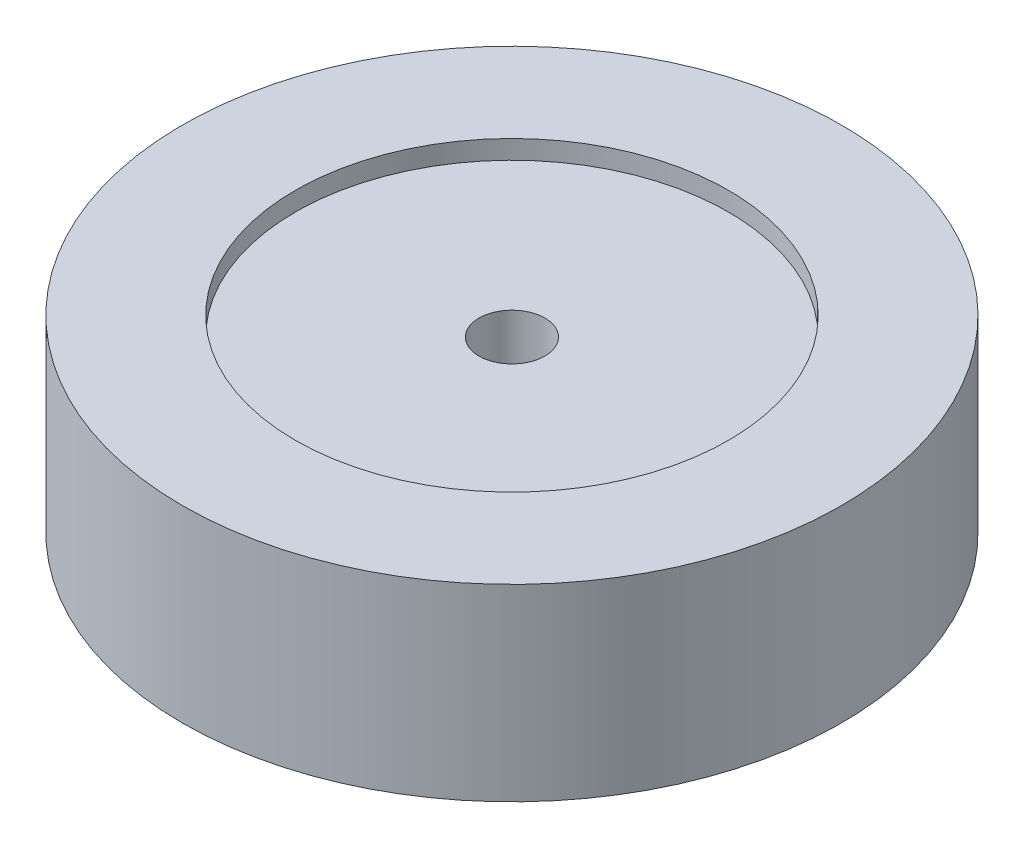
ISO-10303-21;
HEADER;
FILE_DESCRIPTION(('STEP AP214'),'2;1');
FILE_NAME('part.step','',(''),(''),'','','');
FILE_SCHEMA(('AUTOMOTIVE_DESIGN { 1 0 10303 214 1 1 1 1 }'));
ENDSEC;
DATA;
#1=APPLICATION_CONTEXT('core data for automotive mechanical design processes');
#2=APPLICATION_PROTOCOL_DEFINITION('international standard','automotive_design',2000,#1);
#3=PRODUCT_CONTEXT('',#1,'mechanical');
#4=PRODUCT('Part','Part','',(#3));
#5=PRODUCT_RELATED_PRODUCT_CATEGORY('part','',(#4));
#6=PRODUCT_DEFINITION_FORMATION('','',#4);
#7=PRODUCT_DEFINITION_CONTEXT('part definition',#1,'design');
#8=PRODUCT_DEFINITION('design','',#6,#7);
#9=PRODUCT_DEFINITION_SHAPE('','',#8);
#10=(LENGTH_UNIT() NAMED_UNIT(*) SI_UNIT(.MILLI.,.METRE.));
#11=(NAMED_UNIT(*) PLANE_ANGLE_UNIT() SI_UNIT($,.RADIAN.));
#12=(NAMED_UNIT(*) SI_UNIT($,.STERADIAN.) SOLID_ANGLE_UNIT());
#13=UNCERTAINTY_MEASURE_WITH_UNIT(LENGTH_MEASURE(1.E-05),#10,'distance_accuracy_value','');
#14=(GEOMETRIC_REPRESENTATION_CONTEXT(3) GLOBAL_UNCERTAINTY_ASSIGNED_CONTEXT((#13)) GLOBAL_UNIT_ASSIGNED_CONTEXT((#10,
#11,#12)) REPRESENTATION_CONTEXT('',''));
#15=CARTESIAN_POINT('',(0.,0.,0.));
#16=DIRECTION('',(0.,0.,1.));
#17=DIRECTION('',(1.,0.,0.));
#18=AXIS2_PLACEMENT_3D('',#15,#16,#17);
#19=CARTESIAN_POINT('',(0.,10.,0.));
#20=DIRECTION('',(0.,-1.,0.));
#21=DIRECTION('',(0.,0.,-1.));
#22=AXIS2_PLACEMENT_3D('',#19,#20,#21);
#23=CYLINDRICAL_SURFACE('',#22,1.75);
#24=CARTESIAN_POINT('',(0.,0.,0.));
#25=DIRECTION('',(0.,1.,0.));
#26=DIRECTION('',(0.,0.,1.));
#27=AXIS2_PLACEMENT_3D('',#24,#25,#26);
#28=CIRCLE('',#27,1.75);
#29=CARTESIAN_POINT('',(0.,0.,1.75));
#30=VERTEX_POINT('',#29);
#31=EDGE_CURVE('E40',#30,#30,#28,.T.);
#32=ORIENTED_EDGE('',*,*,#31,.F.);
#33=EDGE_LOOP('',(#32));
#34=FACE_BOUND('',#33,.T.);
#35=CARTESIAN_POINT('',(0.,9.,0.));
#36=DIRECTION('',(0.,1.,0.));
#37=DIRECTION('',(0.,0.,1.));
#38=AXIS2_PLACEMENT_3D('',#35,#36,#37);
#39=CIRCLE('',#38,1.75);
#40=CARTESIAN_POINT('',(0.,9.,1.75));
#41=VERTEX_POINT('',#40);
#42=EDGE_CURVE('E32',#41,#41,#39,.T.);
#43=ORIENTED_EDGE('',*,*,#42,.T.);
#44=EDGE_LOOP('',(#43));
#45=FACE_BOUND('',#44,.T.);
#46=ADVANCED_FACE('F28',(#34,#45),#23,.F.);
#47=CARTESIAN_POINT('',(0.,10.,0.));
#48=DIRECTION('',(0.,1.,0.));
#49=DIRECTION('',(0.,0.,1.));
#50=AXIS2_PLACEMENT_3D('',#47,#48,#49);
#51=PLANE('',#50);
#52=CARTESIAN_POINT('',(0.,10.,0.));
#53=DIRECTION('',(0.,1.,0.));
#54=DIRECTION('',(0.,0.,1.));
#55=AXIS2_PLACEMENT_3D('',#52,#53,#54);
#56=CIRCLE('',#55,11.5);
#57=CARTESIAN_POINT('',(0.,10.,11.5));
#58=VERTEX_POINT('',#57);
#59=EDGE_CURVE('E48',#58,#58,#56,.T.);
#60=ORIENTED_EDGE('',*,*,#59,.F.);
#61=EDGE_LOOP('',(#60));
#62=FACE_BOUND('',#61,.T.);
#63=CARTESIAN_POINT('',(0.,10.,0.));
#64=DIRECTION('',(0.,1.,0.));
#65=DIRECTION('',(0.,0.,1.));
#66=AXIS2_PLACEMENT_3D('',#63,#64,#65);
#67=CIRCLE('',#66,17.5);
#68=CARTESIAN_POINT('',(0.,10.,17.5));
#69=VERTEX_POINT('',#68);
#70=EDGE_CURVE('E10',#69,#69,#67,.T.);
#71=ORIENTED_EDGE('',*,*,#70,.T.);
#72=EDGE_LOOP('',(#71));
#73=FACE_BOUND('',#72,.T.);
#74=ADVANCED_FACE('F54',(#62,#73),#51,.T.);
#75=CARTESIAN_POINT('',(0.,0.,0.));
#76=DIRECTION('',(0.,1.,0.));
#77=DIRECTION('',(0.,0.,1.));
#78=AXIS2_PLACEMENT_3D('',#75,#76,#77);
#79=PLANE('',#78);
#80=CARTESIAN_POINT('',(0.,0.,0.));
#81=DIRECTION('',(0.,1.,0.));
#82=DIRECTION('',(0.,0.,1.));
#83=AXIS2_PLACEMENT_3D('',#80,#81,#82);
#84=CIRCLE('',#83,17.5);
#85=CARTESIAN_POINT('',(0.,0.,17.5));
#86=VERTEX_POINT('',#85);
#87=EDGE_CURVE('E36',#86,#86,#84,.T.);
#88=ORIENTED_EDGE('',*,*,#87,.F.);
#89=EDGE_LOOP('',(#88));
#90=FACE_BOUND('',#89,.T.);
#91=ORIENTED_EDGE('',*,*,#31,.T.);
#92=EDGE_LOOP('',(#91));
#93=FACE_BOUND('',#92,.T.);
#94=ADVANCED_FACE('F56',(#90,#93),#79,.F.);
#95=CARTESIAN_POINT('',(0.,10.,0.));
#96=DIRECTION('',(0.,-1.,0.));
#97=DIRECTION('',(0.,0.,-1.));
#98=AXIS2_PLACEMENT_3D('',#95,#96,#97);
#99=CYLINDRICAL_SURFACE('',#98,17.5);
#100=ORIENTED_EDGE('',*,*,#70,.F.);
#101=EDGE_LOOP('',(#100));
#102=FACE_BOUND('',#101,.T.);
#103=ORIENTED_EDGE('',*,*,#87,.T.);
#104=EDGE_LOOP('',(#103));
#105=FACE_BOUND('',#104,.T.);
#106=ADVANCED_FACE('F30',(#102,#105),#99,.T.);
#107=CARTESIAN_POINT('',(0.,9.,0.));
#108=DIRECTION('',(0.,1.,0.));
#109=DIRECTION('',(0.,0.,1.));
#110=AXIS2_PLACEMENT_3D('',#107,#108,#109);
#111=CYLINDRICAL_SURFACE('',#110,11.5);
#112=CARTESIAN_POINT('',(0.,9.,0.));
#113=DIRECTION('',(0.,1.,0.));
#114=DIRECTION('',(0.,0.,1.));
#115=AXIS2_PLACEMENT_3D('',#112,#113,#114);
#116=CIRCLE('',#115,11.5);
#117=CARTESIAN_POINT('',(0.,9.,11.5));
#118=VERTEX_POINT('',#117);
#119=EDGE_CURVE('E45',#118,#118,#116,.T.);
#120=ORIENTED_EDGE('',*,*,#119,.F.);
#121=EDGE_LOOP('',(#120));
#122=FACE_BOUND('',#121,.T.);
#123=ORIENTED_EDGE('',*,*,#59,.T.);
#124=EDGE_LOOP('',(#123));
#125=FACE_BOUND('',#124,.T.);
#126=ADVANCED_FACE('F52',(#122,#125),#111,.F.);
#127=CARTESIAN_POINT('',(0.,9.,0.));
#128=DIRECTION('',(0.,1.,0.));
#129=DIRECTION('',(0.,0.,1.));
#130=AXIS2_PLACEMENT_3D('',#127,#128,#129);
#131=PLANE('',#130);
#132=ORIENTED_EDGE('',*,*,#42,.F.);
#133=EDGE_LOOP('',(#132));
#134=FACE_BOUND('',#133,.T.);
#135=ORIENTED_EDGE('',*,*,#119,.T.);
#136=EDGE_LOOP('',(#135));
#137=FACE_BOUND('',#136,.T.);
#138=ADVANCED_FACE('F68',(#134,#137),#131,.T.);
#139=CLOSED_SHELL('',(#46,#74,#94,#106,#126,#138));
#140=MANIFOLD_SOLID_BREP('B2',#139);
#141=ADVANCED_BREP_SHAPE_REPRESENTATION('',(#18,#140),#14);
#142=SHAPE_DEFINITION_REPRESENTATION(#9,#141);
ENDSEC;
END-ISO-10303-21;
